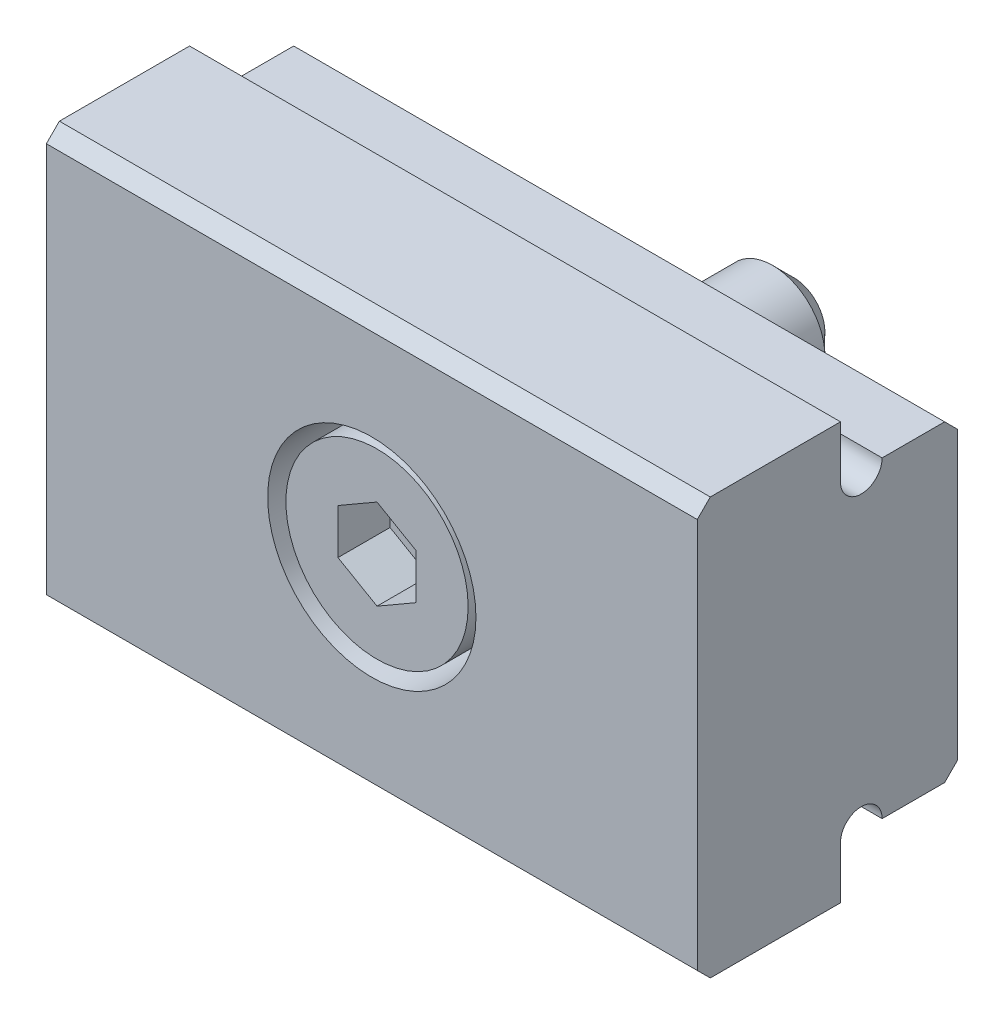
ISO-10303-21;
HEADER;
FILE_DESCRIPTION(('STEP AP214'),'2;1');
FILE_NAME('part.step','',(''),(''),'','','');
FILE_SCHEMA(('AUTOMOTIVE_DESIGN { 1 0 10303 214 1 1 1 1 }'));
ENDSEC;
DATA;
#1=APPLICATION_CONTEXT('core data for automotive mechanical design processes');
#2=APPLICATION_PROTOCOL_DEFINITION('international standard','automotive_design',2000,#1);
#3=PRODUCT_CONTEXT('',#1,'mechanical');
#4=PRODUCT('Part','Part','',(#3));
#5=PRODUCT_RELATED_PRODUCT_CATEGORY('part','',(#4));
#6=PRODUCT_DEFINITION_FORMATION('','',#4);
#7=PRODUCT_DEFINITION_CONTEXT('part definition',#1,'design');
#8=PRODUCT_DEFINITION('design','',#6,#7);
#9=PRODUCT_DEFINITION_SHAPE('','',#8);
#10=(LENGTH_UNIT() NAMED_UNIT(*) SI_UNIT(.MILLI.,.METRE.));
#11=(NAMED_UNIT(*) PLANE_ANGLE_UNIT() SI_UNIT($,.RADIAN.));
#12=(NAMED_UNIT(*) SI_UNIT($,.STERADIAN.) SOLID_ANGLE_UNIT());
#13=UNCERTAINTY_MEASURE_WITH_UNIT(LENGTH_MEASURE(1.E-05),#10,'distance_accuracy_value','');
#14=(GEOMETRIC_REPRESENTATION_CONTEXT(3) GLOBAL_UNCERTAINTY_ASSIGNED_CONTEXT((#13)) GLOBAL_UNIT_ASSIGNED_CONTEXT((#10,
#11,#12)) REPRESENTATION_CONTEXT('',''));
#15=CARTESIAN_POINT('',(0.,0.,0.));
#16=DIRECTION('',(0.,0.,1.));
#17=DIRECTION('',(1.,0.,0.));
#18=AXIS2_PLACEMENT_3D('',#15,#16,#17);
#19=CARTESIAN_POINT('',(2.,0.,-10.7));
#20=DIRECTION('',(0.,0.,-1.));
#21=DIRECTION('',(-1.,0.,0.));
#22=AXIS2_PLACEMENT_3D('',#19,#20,#21);
#23=PLANE('',#22);
#24=CARTESIAN_POINT('',(0.,0.,-10.7));
#25=DIRECTION('',(0.,0.,-1.));
#26=DIRECTION('',(-1.,0.,0.));
#27=AXIS2_PLACEMENT_3D('',#24,#25,#26);
#28=CIRCLE('',#27,1.2);
#29=CARTESIAN_POINT('',(-1.2,0.,-10.7));
#30=VERTEX_POINT('',#29);
#31=EDGE_CURVE('E24',#30,#30,#28,.T.);
#32=ORIENTED_EDGE('',*,*,#31,.T.);
#33=EDGE_LOOP('',(#32));
#34=FACE_BOUND('',#33,.T.);
#35=ADVANCED_FACE('F14',(#34),#23,.T.);
#36=CARTESIAN_POINT('',(0.,0.,-9.9));
#37=DIRECTION('',(0.,0.,1.));
#38=DIRECTION('',(1.,0.,0.));
#39=AXIS2_PLACEMENT_3D('',#36,#37,#38);
#40=CONICAL_SURFACE('',#39,2.,0.785398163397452);
#41=ORIENTED_EDGE('',*,*,#31,.F.);
#42=EDGE_LOOP('',(#41));
#43=FACE_BOUND('',#42,.T.);
#44=CARTESIAN_POINT('',(0.,0.,-9.9));
#45=DIRECTION('',(0.,0.,-1.));
#46=DIRECTION('',(-1.,0.,0.));
#47=AXIS2_PLACEMENT_3D('',#44,#45,#46);
#48=CIRCLE('',#47,2.);
#49=CARTESIAN_POINT('',(-2.,0.,-9.9));
#50=VERTEX_POINT('',#49);
#51=EDGE_CURVE('E212',#50,#50,#48,.F.);
#52=ORIENTED_EDGE('',*,*,#51,.F.);
#53=EDGE_LOOP('',(#52));
#54=FACE_BOUND('',#53,.T.);
#55=ADVANCED_FACE('F371',(#43,#54),#40,.T.);
#56=CARTESIAN_POINT('',(0.,0.,9.3));
#57=DIRECTION('',(0.,0.,1.));
#58=DIRECTION('',(1.,0.,0.));
#59=AXIS2_PLACEMENT_3D('',#56,#57,#58);
#60=CYLINDRICAL_SURFACE('',#59,2.);
#61=ORIENTED_EDGE('',*,*,#51,.T.);
#62=EDGE_LOOP('',(#61));
#63=FACE_BOUND('',#62,.T.);
#64=CARTESIAN_POINT('',(0.,0.,1.30000000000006));
#65=DIRECTION('',(0.,0.,1.));
#66=DIRECTION('',(1.,0.,0.));
#67=AXIS2_PLACEMENT_3D('',#64,#65,#66);
#68=CIRCLE('',#67,2.);
#69=CARTESIAN_POINT('',(2.,0.,1.30000000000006));
#70=VERTEX_POINT('',#69);
#71=EDGE_CURVE('E203',#70,#70,#68,.T.);
#72=ORIENTED_EDGE('',*,*,#71,.F.);
#73=EDGE_LOOP('',(#72));
#74=FACE_BOUND('',#73,.T.);
#75=ADVANCED_FACE('F360',(#63,#74),#60,.T.);
#76=CARTESIAN_POINT('',(3.5,0.,1.30000000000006));
#77=DIRECTION('',(0.,0.,-1.));
#78=DIRECTION('',(-1.,0.,0.));
#79=AXIS2_PLACEMENT_3D('',#76,#77,#78);
#80=PLANE('',#79);
#81=ORIENTED_EDGE('',*,*,#71,.T.);
#82=EDGE_LOOP('',(#81));
#83=FACE_BOUND('',#82,.T.);
#84=CARTESIAN_POINT('',(0.,0.,1.30000000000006));
#85=DIRECTION('',(0.,0.,-1.));
#86=DIRECTION('',(-1.,0.,0.));
#87=AXIS2_PLACEMENT_3D('',#84,#85,#86);
#88=CIRCLE('',#87,2.4);
#89=CARTESIAN_POINT('',(-2.4,0.,1.30000000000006));
#90=VERTEX_POINT('',#89);
#91=EDGE_CURVE('E9',#90,#90,#88,.T.);
#92=ORIENTED_EDGE('',*,*,#91,.T.);
#93=EDGE_LOOP('',(#92));
#94=FACE_BOUND('',#93,.T.);
#95=ADVANCED_FACE('F350',(#83,#94),#80,.T.);
#96=CARTESIAN_POINT('',(0.,1.73205080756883,3.30000000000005));
#97=DIRECTION('',(-0.5,-0.86602540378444,0.));
#98=DIRECTION('',(0.86602540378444,-0.5,0.));
#99=AXIS2_PLACEMENT_3D('',#96,#97,#98);
#100=PLANE('',#99);
#101=DIRECTION('',(0.,0.,1.));
#102=VECTOR('',#101,1.);
#103=CARTESIAN_POINT('',(1.5,0.866025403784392,3.30000000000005));
#104=LINE('',#103,#102);
#105=CARTESIAN_POINT('',(1.5,0.866025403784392,3.30000000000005));
#106=VERTEX_POINT('',#105);
#107=CARTESIAN_POINT('',(1.5,0.866025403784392,5.30000000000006));
#108=VERTEX_POINT('',#107);
#109=EDGE_CURVE('E132',#106,#108,#104,.T.);
#110=ORIENTED_EDGE('',*,*,#109,.T.);
#111=DIRECTION('',(0.86602540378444,-0.5,0.));
#112=VECTOR('',#111,1.);
#113=CARTESIAN_POINT('',(0.,1.73205080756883,5.30000000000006));
#114=LINE('',#113,#112);
#115=CARTESIAN_POINT('',(0.,1.73205080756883,5.30000000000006));
#116=VERTEX_POINT('',#115);
#117=EDGE_CURVE('E33',#116,#108,#114,.T.);
#118=ORIENTED_EDGE('',*,*,#117,.F.);
#119=DIRECTION('',(0.,0.,1.));
#120=VECTOR('',#119,1.);
#121=CARTESIAN_POINT('',(0.,1.73205080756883,3.30000000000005));
#122=LINE('',#121,#120);
#123=CARTESIAN_POINT('',(0.,1.73205080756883,3.30000000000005));
#124=VERTEX_POINT('',#123);
#125=EDGE_CURVE('E171',#124,#116,#122,.T.);
#126=ORIENTED_EDGE('',*,*,#125,.F.);
#127=DIRECTION('',(0.86602540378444,-0.5,0.));
#128=VECTOR('',#127,1.);
#129=CARTESIAN_POINT('',(0.,1.73205080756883,3.30000000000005));
#130=LINE('',#129,#128);
#131=EDGE_CURVE('E184',#124,#106,#130,.T.);
#132=ORIENTED_EDGE('',*,*,#131,.T.);
#133=EDGE_LOOP('',(#110,#118,#126,#132));
#134=FACE_BOUND('',#133,.T.);
#135=ADVANCED_FACE('F348',(#134),#100,.T.);
#136=CARTESIAN_POINT('',(1.5,-0.86602540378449,3.30000000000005));
#137=DIRECTION('',(1.,0.,0.));
#138=DIRECTION('',(0.,1.,0.));
#139=AXIS2_PLACEMENT_3D('',#136,#137,#138);
#140=PLANE('',#139);
#141=DIRECTION('',(0.,0.,1.));
#142=VECTOR('',#141,1.);
#143=CARTESIAN_POINT('',(1.5,-0.86602540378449,3.30000000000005));
#144=LINE('',#143,#142);
#145=CARTESIAN_POINT('',(1.5,-0.86602540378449,3.30000000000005));
#146=VERTEX_POINT('',#145);
#147=CARTESIAN_POINT('',(1.5,-0.86602540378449,5.30000000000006));
#148=VERTEX_POINT('',#147);
#149=EDGE_CURVE('E200',#146,#148,#144,.T.);
#150=ORIENTED_EDGE('',*,*,#149,.T.);
#151=DIRECTION('',(0.,1.,0.));
#152=VECTOR('',#151,1.);
#153=CARTESIAN_POINT('',(1.5,-0.86602540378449,5.30000000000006));
#154=LINE('',#153,#152);
#155=EDGE_CURVE('E325',#148,#108,#154,.T.);
#156=ORIENTED_EDGE('',*,*,#155,.T.);
#157=ORIENTED_EDGE('',*,*,#109,.F.);
#158=DIRECTION('',(0.,1.,0.));
#159=VECTOR('',#158,1.);
#160=CARTESIAN_POINT('',(1.5,-0.86602540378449,3.30000000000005));
#161=LINE('',#160,#159);
#162=EDGE_CURVE('E194',#146,#106,#161,.T.);
#163=ORIENTED_EDGE('',*,*,#162,.F.);
#164=EDGE_LOOP('',(#150,#156,#157,#163));
#165=FACE_BOUND('',#164,.T.);
#166=ADVANCED_FACE('F347',(#165),#140,.F.);
#167=CARTESIAN_POINT('',(0.,-1.73205080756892,3.30000000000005));
#168=DIRECTION('',(0.5,-0.86602540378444,0.));
#169=DIRECTION('',(0.86602540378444,0.5,0.));
#170=AXIS2_PLACEMENT_3D('',#167,#168,#169);
#171=PLANE('',#170);
#172=DIRECTION('',(0.,0.,1.));
#173=VECTOR('',#172,1.);
#174=CARTESIAN_POINT('',(0.,-1.73205080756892,3.30000000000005));
#175=LINE('',#174,#173);
#176=CARTESIAN_POINT('',(0.,-1.73205080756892,3.30000000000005));
#177=VERTEX_POINT('',#176);
#178=CARTESIAN_POINT('',(0.,-1.73205080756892,5.30000000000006));
#179=VERTEX_POINT('',#178);
#180=EDGE_CURVE('E198',#177,#179,#175,.T.);
#181=ORIENTED_EDGE('',*,*,#180,.T.);
#182=DIRECTION('',(0.86602540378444,0.5,0.));
#183=VECTOR('',#182,1.);
#184=CARTESIAN_POINT('',(0.,-1.73205080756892,5.30000000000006));
#185=LINE('',#184,#183);
#186=EDGE_CURVE('E328',#179,#148,#185,.T.);
#187=ORIENTED_EDGE('',*,*,#186,.T.);
#188=ORIENTED_EDGE('',*,*,#149,.F.);
#189=DIRECTION('',(0.86602540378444,0.5,0.));
#190=VECTOR('',#189,1.);
#191=CARTESIAN_POINT('',(0.,-1.73205080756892,3.30000000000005));
#192=LINE('',#191,#190);
#193=EDGE_CURVE('E191',#177,#146,#192,.T.);
#194=ORIENTED_EDGE('',*,*,#193,.F.);
#195=EDGE_LOOP('',(#181,#187,#188,#194));
#196=FACE_BOUND('',#195,.T.);
#197=ADVANCED_FACE('F346',(#196),#171,.F.);
#198=CARTESIAN_POINT('',(0.,-1.73205080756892,3.30000000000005));
#199=DIRECTION('',(0.5,0.86602540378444,0.));
#200=DIRECTION('',(-0.86602540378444,0.5,0.));
#201=AXIS2_PLACEMENT_3D('',#198,#199,#200);
#202=PLANE('',#201);
#203=DIRECTION('',(0.,0.,1.));
#204=VECTOR('',#203,1.);
#205=CARTESIAN_POINT('',(-1.5,-0.86602540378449,3.30000000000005));
#206=LINE('',#205,#204);
#207=CARTESIAN_POINT('',(-1.5,-0.86602540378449,3.30000000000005));
#208=VERTEX_POINT('',#207);
#209=CARTESIAN_POINT('',(-1.5,-0.86602540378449,5.30000000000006));
#210=VERTEX_POINT('',#209);
#211=EDGE_CURVE('E170',#208,#210,#206,.T.);
#212=ORIENTED_EDGE('',*,*,#211,.T.);
#213=DIRECTION('',(-0.86602540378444,0.5,0.));
#214=VECTOR('',#213,1.);
#215=CARTESIAN_POINT('',(0.,-1.73205080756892,5.30000000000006));
#216=LINE('',#215,#214);
#217=EDGE_CURVE('E331',#179,#210,#216,.T.);
#218=ORIENTED_EDGE('',*,*,#217,.F.);
#219=ORIENTED_EDGE('',*,*,#180,.F.);
#220=DIRECTION('',(-0.86602540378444,0.5,0.));
#221=VECTOR('',#220,1.);
#222=CARTESIAN_POINT('',(0.,-1.73205080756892,3.30000000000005));
#223=LINE('',#222,#221);
#224=EDGE_CURVE('E179',#177,#208,#223,.T.);
#225=ORIENTED_EDGE('',*,*,#224,.T.);
#226=EDGE_LOOP('',(#212,#218,#219,#225));
#227=FACE_BOUND('',#226,.T.);
#228=ADVANCED_FACE('F342',(#227),#202,.T.);
#229=CARTESIAN_POINT('',(-1.5,0.866025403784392,3.30000000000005));
#230=DIRECTION('',(-1.,0.,0.));
#231=DIRECTION('',(0.,-1.,0.));
#232=AXIS2_PLACEMENT_3D('',#229,#230,#231);
#233=PLANE('',#232);
#234=DIRECTION('',(0.,0.,1.));
#235=VECTOR('',#234,1.);
#236=CARTESIAN_POINT('',(-1.5,0.866025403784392,3.30000000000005));
#237=LINE('',#236,#235);
#238=CARTESIAN_POINT('',(-1.5,0.866025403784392,3.30000000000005));
#239=VERTEX_POINT('',#238);
#240=CARTESIAN_POINT('',(-1.5,0.866025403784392,5.30000000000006));
#241=VERTEX_POINT('',#240);
#242=EDGE_CURVE('E160',#239,#241,#237,.T.);
#243=ORIENTED_EDGE('',*,*,#242,.T.);
#244=DIRECTION('',(0.,-1.,0.));
#245=VECTOR('',#244,1.);
#246=CARTESIAN_POINT('',(-1.5,0.866025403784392,5.30000000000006));
#247=LINE('',#246,#245);
#248=EDGE_CURVE('E336',#241,#210,#247,.T.);
#249=ORIENTED_EDGE('',*,*,#248,.T.);
#250=ORIENTED_EDGE('',*,*,#211,.F.);
#251=DIRECTION('',(0.,-1.,0.));
#252=VECTOR('',#251,1.);
#253=CARTESIAN_POINT('',(-1.5,0.866025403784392,3.30000000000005));
#254=LINE('',#253,#252);
#255=EDGE_CURVE('E174',#239,#208,#254,.T.);
#256=ORIENTED_EDGE('',*,*,#255,.F.);
#257=EDGE_LOOP('',(#243,#249,#250,#256));
#258=FACE_BOUND('',#257,.T.);
#259=ADVANCED_FACE('F175',(#258),#233,.F.);
#260=CARTESIAN_POINT('',(0.,1.73205080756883,3.30000000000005));
#261=DIRECTION('',(-0.5,0.86602540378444,0.));
#262=DIRECTION('',(-0.86602540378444,-0.5,0.));
#263=AXIS2_PLACEMENT_3D('',#260,#261,#262);
#264=PLANE('',#263);
#265=DIRECTION('',(-0.86602540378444,-0.5,0.));
#266=VECTOR('',#265,1.);
#267=CARTESIAN_POINT('',(0.,1.73205080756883,3.30000000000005));
#268=LINE('',#267,#266);
#269=EDGE_CURVE('E164',#124,#239,#268,.T.);
#270=ORIENTED_EDGE('',*,*,#269,.F.);
#271=ORIENTED_EDGE('',*,*,#125,.T.);
#272=DIRECTION('',(-0.86602540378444,-0.5,0.));
#273=VECTOR('',#272,1.);
#274=CARTESIAN_POINT('',(0.,1.73205080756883,5.30000000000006));
#275=LINE('',#274,#273);
#276=EDGE_CURVE('E166',#116,#241,#275,.T.);
#277=ORIENTED_EDGE('',*,*,#276,.T.);
#278=ORIENTED_EDGE('',*,*,#242,.F.);
#279=EDGE_LOOP('',(#270,#271,#277,#278));
#280=FACE_BOUND('',#279,.T.);
#281=ADVANCED_FACE('F162',(#280),#264,.F.);
#282=CARTESIAN_POINT('',(1.5,0.866025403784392,3.30000000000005));
#283=DIRECTION('',(0.,0.,1.));
#284=DIRECTION('',(1.,0.,0.));
#285=AXIS2_PLACEMENT_3D('',#282,#283,#284);
#286=PLANE('',#285);
#287=ORIENTED_EDGE('',*,*,#131,.F.);
#288=ORIENTED_EDGE('',*,*,#269,.T.);
#289=ORIENTED_EDGE('',*,*,#255,.T.);
#290=ORIENTED_EDGE('',*,*,#224,.F.);
#291=ORIENTED_EDGE('',*,*,#193,.T.);
#292=ORIENTED_EDGE('',*,*,#162,.T.);
#293=EDGE_LOOP('',(#287,#288,#289,#290,#291,#292));
#294=FACE_BOUND('',#293,.T.);
#295=ADVANCED_FACE('F182',(#294),#286,.T.);
#296=CARTESIAN_POINT('',(0.,0.,5.30000000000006));
#297=DIRECTION('',(0.,0.,1.));
#298=DIRECTION('',(1.,0.,0.));
#299=AXIS2_PLACEMENT_3D('',#296,#297,#298);
#300=PLANE('',#299);
#301=CARTESIAN_POINT('',(0.,0.,5.30000000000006));
#302=DIRECTION('',(0.,0.,1.));
#303=DIRECTION('',(1.,0.,0.));
#304=AXIS2_PLACEMENT_3D('',#301,#302,#303);
#305=CIRCLE('',#304,3.5);
#306=CARTESIAN_POINT('',(3.5,0.,5.30000000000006));
#307=VERTEX_POINT('',#306);
#308=EDGE_CURVE('E209',#307,#307,#305,.T.);
#309=ORIENTED_EDGE('',*,*,#308,.T.);
#310=EDGE_LOOP('',(#309));
#311=FACE_BOUND('',#310,.T.);
#312=ORIENTED_EDGE('',*,*,#276,.F.);
#313=ORIENTED_EDGE('',*,*,#117,.T.);
#314=ORIENTED_EDGE('',*,*,#155,.F.);
#315=ORIENTED_EDGE('',*,*,#186,.F.);
#316=ORIENTED_EDGE('',*,*,#217,.T.);
#317=ORIENTED_EDGE('',*,*,#248,.F.);
#318=EDGE_LOOP('',(#312,#313,#314,#315,#316,#317));
#319=FACE_BOUND('',#318,.T.);
#320=ADVANCED_FACE('F340',(#311,#319),#300,.T.);
#321=CARTESIAN_POINT('',(0.,0.,9.3));
#322=DIRECTION('',(0.,0.,1.));
#323=DIRECTION('',(1.,0.,0.));
#324=AXIS2_PLACEMENT_3D('',#321,#322,#323);
#325=CYLINDRICAL_SURFACE('',#324,3.5);
#326=CARTESIAN_POINT('',(0.,0.,1.30000000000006));
#327=DIRECTION('',(0.,0.,1.));
#328=DIRECTION('',(1.,0.,0.));
#329=AXIS2_PLACEMENT_3D('',#326,#327,#328);
#330=CIRCLE('',#329,3.5);
#331=CARTESIAN_POINT('',(3.5,0.,1.30000000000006));
#332=VERTEX_POINT('',#331);
#333=EDGE_CURVE('E206',#332,#332,#330,.T.);
#334=ORIENTED_EDGE('',*,*,#333,.T.);
#335=EDGE_LOOP('',(#334));
#336=FACE_BOUND('',#335,.T.);
#337=ORIENTED_EDGE('',*,*,#308,.F.);
#338=EDGE_LOOP('',(#337));
#339=FACE_BOUND('',#338,.T.);
#340=ADVANCED_FACE('F385',(#336,#339),#325,.T.);
#341=CARTESIAN_POINT('',(12.5,6.,0.));
#342=DIRECTION('',(0.,0.,1.));
#343=DIRECTION('',(0.,-1.,0.));
#344=AXIS2_PLACEMENT_3D('',#341,#342,#343);
#345=PLANE('',#344);
#346=DIRECTION('',(0.,1.,0.));
#347=VECTOR('',#346,1.);
#348=CARTESIAN_POINT('',(-12.5,6.,0.));
#349=LINE('',#348,#347);
#350=CARTESIAN_POINT('',(-12.5,6.,0.));
#351=VERTEX_POINT('',#350);
#352=CARTESIAN_POINT('',(-12.5,8.,0.));
#353=VERTEX_POINT('',#352);
#354=EDGE_CURVE('E229',#351,#353,#349,.T.);
#355=ORIENTED_EDGE('',*,*,#354,.T.);
#356=DIRECTION('',(-1.,0.,0.));
#357=VECTOR('',#356,1.);
#358=CARTESIAN_POINT('',(12.5,8.,0.));
#359=LINE('',#358,#357);
#360=CARTESIAN_POINT('',(12.5,8.,0.));
#361=VERTEX_POINT('',#360);
#362=EDGE_CURVE('E316',#361,#353,#359,.T.);
#363=ORIENTED_EDGE('',*,*,#362,.F.);
#364=DIRECTION('',(0.,1.,0.));
#365=VECTOR('',#364,1.);
#366=CARTESIAN_POINT('',(12.5,6.,0.));
#367=LINE('',#366,#365);
#368=CARTESIAN_POINT('',(12.5,6.,0.));
#369=VERTEX_POINT('',#368);
#370=EDGE_CURVE('E257',#369,#361,#367,.T.);
#371=ORIENTED_EDGE('',*,*,#370,.F.);
#372=DIRECTION('',(-1.,0.,0.));
#373=VECTOR('',#372,1.);
#374=CARTESIAN_POINT('',(12.5,6.,0.));
#375=LINE('',#374,#373);
#376=EDGE_CURVE('E18',#369,#351,#375,.T.);
#377=ORIENTED_EDGE('',*,*,#376,.T.);
#378=EDGE_LOOP('',(#355,#363,#371,#377));
#379=FACE_BOUND('',#378,.T.);
#380=ADVANCED_FACE('F388',(#379),#345,.F.);
#381=CARTESIAN_POINT('',(12.5,8.,5.00000000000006));
#382=DIRECTION('',(0.,-1.,0.));
#383=DIRECTION('',(1.,0.,0.));
#384=AXIS2_PLACEMENT_3D('',#381,#382,#383);
#385=PLANE('',#384);
#386=DIRECTION('',(0.,0.,1.));
#387=VECTOR('',#386,1.);
#388=CARTESIAN_POINT('',(-12.5,8.,5.00000000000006));
#389=LINE('',#388,#387);
#390=CARTESIAN_POINT('',(-12.5,8.,5.00000000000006));
#391=VERTEX_POINT('',#390);
#392=EDGE_CURVE('E231',#353,#391,#389,.T.);
#393=ORIENTED_EDGE('',*,*,#392,.T.);
#394=DIRECTION('',(-1.,0.,0.));
#395=VECTOR('',#394,1.);
#396=CARTESIAN_POINT('',(12.5,8.,5.00000000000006));
#397=LINE('',#396,#395);
#398=CARTESIAN_POINT('',(12.5,8.,5.00000000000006));
#399=VERTEX_POINT('',#398);
#400=EDGE_CURVE('E314',#399,#391,#397,.T.);
#401=ORIENTED_EDGE('',*,*,#400,.F.);
#402=DIRECTION('',(0.,0.,1.));
#403=VECTOR('',#402,1.);
#404=CARTESIAN_POINT('',(12.5,8.,5.00000000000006));
#405=LINE('',#404,#403);
#406=EDGE_CURVE('E259',#361,#399,#405,.T.);
#407=ORIENTED_EDGE('',*,*,#406,.F.);
#408=ORIENTED_EDGE('',*,*,#362,.T.);
#409=EDGE_LOOP('',(#393,#401,#407,#408));
#410=FACE_BOUND('',#409,.T.);
#411=ADVANCED_FACE('F449',(#410),#385,.F.);
#412=CARTESIAN_POINT('',(12.5,7.5,5.5));
#413=DIRECTION('',(0.,-0.707106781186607,-0.707106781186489));
#414=DIRECTION('',(0.,0.707106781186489,-0.707106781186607));
#415=AXIS2_PLACEMENT_3D('',#412,#413,#414);
#416=PLANE('',#415);
#417=DIRECTION('',(0.,-0.707106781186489,0.707106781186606));
#418=VECTOR('',#417,1.);
#419=CARTESIAN_POINT('',(-12.5,7.5,5.5));
#420=LINE('',#419,#418);
#421=CARTESIAN_POINT('',(-12.5,7.5,5.5));
#422=VERTEX_POINT('',#421);
#423=EDGE_CURVE('E233',#391,#422,#420,.T.);
#424=ORIENTED_EDGE('',*,*,#423,.T.);
#425=DIRECTION('',(-1.,0.,0.));
#426=VECTOR('',#425,1.);
#427=CARTESIAN_POINT('',(12.5,7.5,5.5));
#428=LINE('',#427,#426);
#429=CARTESIAN_POINT('',(12.5,7.5,5.5));
#430=VERTEX_POINT('',#429);
#431=EDGE_CURVE('E311',#430,#422,#428,.T.);
#432=ORIENTED_EDGE('',*,*,#431,.F.);
#433=DIRECTION('',(0.,-0.707106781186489,0.707106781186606));
#434=VECTOR('',#433,1.);
#435=CARTESIAN_POINT('',(12.5,7.5,5.5));
#436=LINE('',#435,#434);
#437=EDGE_CURVE('E261',#399,#430,#436,.T.);
#438=ORIENTED_EDGE('',*,*,#437,.F.);
#439=ORIENTED_EDGE('',*,*,#400,.T.);
#440=EDGE_LOOP('',(#424,#432,#438,#439));
#441=FACE_BOUND('',#440,.T.);
#442=ADVANCED_FACE('F445',(#441),#416,.F.);
#443=CARTESIAN_POINT('',(12.5,7.5,5.5));
#444=DIRECTION('',(0.,0.,-1.));
#445=DIRECTION('',(0.,1.,0.));
#446=AXIS2_PLACEMENT_3D('',#443,#444,#445);
#447=PLANE('',#446);
#448=CARTESIAN_POINT('',(0.,0.,5.5));
#449=DIRECTION('',(0.,0.,1.));
#450=DIRECTION('',(1.,0.,0.));
#451=AXIS2_PLACEMENT_3D('',#448,#449,#450);
#452=CIRCLE('',#451,4.);
#453=CARTESIAN_POINT('',(4.,0.,5.5));
#454=VERTEX_POINT('',#453);
#455=EDGE_CURVE('E223',#454,#454,#452,.T.);
#456=ORIENTED_EDGE('',*,*,#455,.F.);
#457=EDGE_LOOP('',(#456));
#458=FACE_BOUND('',#457,.T.);
#459=DIRECTION('',(0.,-1.,0.));
#460=VECTOR('',#459,1.);
#461=CARTESIAN_POINT('',(-12.5,7.5,5.5));
#462=LINE('',#461,#460);
#463=CARTESIAN_POINT('',(-12.5,-7.5,5.5));
#464=VERTEX_POINT('',#463);
#465=EDGE_CURVE('E235',#422,#464,#462,.T.);
#466=ORIENTED_EDGE('',*,*,#465,.T.);
#467=DIRECTION('',(-1.,0.,0.));
#468=VECTOR('',#467,1.);
#469=CARTESIAN_POINT('',(12.5,-7.5,5.5));
#470=LINE('',#469,#468);
#471=CARTESIAN_POINT('',(12.5,-7.5,5.5));
#472=VERTEX_POINT('',#471);
#473=EDGE_CURVE('E308',#472,#464,#470,.T.);
#474=ORIENTED_EDGE('',*,*,#473,.F.);
#475=DIRECTION('',(0.,-1.,0.));
#476=VECTOR('',#475,1.);
#477=CARTESIAN_POINT('',(12.5,7.5,5.5));
#478=LINE('',#477,#476);
#479=EDGE_CURVE('E263',#430,#472,#478,.T.);
#480=ORIENTED_EDGE('',*,*,#479,.F.);
#481=ORIENTED_EDGE('',*,*,#431,.T.);
#482=EDGE_LOOP('',(#466,#474,#480,#481));
#483=FACE_BOUND('',#482,.T.);
#484=ADVANCED_FACE('F400',(#458,#483),#447,.F.);
#485=CARTESIAN_POINT('',(0.,0.,5.5));
#486=DIRECTION('',(0.,0.,1.));
#487=DIRECTION('',(1.,0.,0.));
#488=AXIS2_PLACEMENT_3D('',#485,#486,#487);
#489=CYLINDRICAL_SURFACE('',#488,4.);
#490=CARTESIAN_POINT('',(0.,0.,1.30000000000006));
#491=DIRECTION('',(0.,0.,1.));
#492=DIRECTION('',(1.,0.,0.));
#493=AXIS2_PLACEMENT_3D('',#490,#491,#492);
#494=CIRCLE('',#493,4.);
#495=CARTESIAN_POINT('',(4.,0.,1.30000000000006));
#496=VERTEX_POINT('',#495);
#497=EDGE_CURVE('E220',#496,#496,#494,.T.);
#498=ORIENTED_EDGE('',*,*,#497,.F.);
#499=EDGE_LOOP('',(#498));
#500=FACE_BOUND('',#499,.T.);
#501=ORIENTED_EDGE('',*,*,#455,.T.);
#502=EDGE_LOOP('',(#501));
#503=FACE_BOUND('',#502,.T.);
#504=ADVANCED_FACE('F396',(#500,#503),#489,.F.);
#505=CARTESIAN_POINT('',(0.,2.39999999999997,1.30000000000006));
#506=DIRECTION('',(0.,0.,-1.));
#507=DIRECTION('',(-1.,0.,0.));
#508=AXIS2_PLACEMENT_3D('',#505,#506,#507);
#509=PLANE('',#508);
#510=ORIENTED_EDGE('',*,*,#333,.F.);
#511=EDGE_LOOP('',(#510));
#512=FACE_BOUND('',#511,.T.);
#513=ORIENTED_EDGE('',*,*,#497,.T.);
#514=EDGE_LOOP('',(#513));
#515=FACE_BOUND('',#514,.T.);
#516=ADVANCED_FACE('F369',(#512,#515),#509,.F.);
#517=CARTESIAN_POINT('',(12.5,-7.5,5.5));
#518=DIRECTION('',(0.,0.707106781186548,-0.707106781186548));
#519=DIRECTION('',(0.,0.707106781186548,0.707106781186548));
#520=AXIS2_PLACEMENT_3D('',#517,#518,#519);
#521=PLANE('',#520);
#522=DIRECTION('',(0.,-0.707106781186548,-0.707106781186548));
#523=VECTOR('',#522,1.);
#524=CARTESIAN_POINT('',(-12.5,-7.5,5.5));
#525=LINE('',#524,#523);
#526=CARTESIAN_POINT('',(-12.5,-8.,5.00000000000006));
#527=VERTEX_POINT('',#526);
#528=EDGE_CURVE('E237',#464,#527,#525,.T.);
#529=ORIENTED_EDGE('',*,*,#528,.T.);
#530=DIRECTION('',(-1.,0.,0.));
#531=VECTOR('',#530,1.);
#532=CARTESIAN_POINT('',(12.5,-8.,5.00000000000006));
#533=LINE('',#532,#531);
#534=CARTESIAN_POINT('',(12.5,-8.,5.00000000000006));
#535=VERTEX_POINT('',#534);
#536=EDGE_CURVE('E305',#535,#527,#533,.T.);
#537=ORIENTED_EDGE('',*,*,#536,.F.);
#538=DIRECTION('',(0.,-0.707106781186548,-0.707106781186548));
#539=VECTOR('',#538,1.);
#540=CARTESIAN_POINT('',(12.5,-7.5,5.5));
#541=LINE('',#540,#539);
#542=EDGE_CURVE('E265',#472,#535,#541,.T.);
#543=ORIENTED_EDGE('',*,*,#542,.F.);
#544=ORIENTED_EDGE('',*,*,#473,.T.);
#545=EDGE_LOOP('',(#529,#537,#543,#544));
#546=FACE_BOUND('',#545,.T.);
#547=ADVANCED_FACE('F395',(#546),#521,.F.);
#548=CARTESIAN_POINT('',(12.5,-8.,5.00000000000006));
#549=DIRECTION('',(0.,1.,0.));
#550=DIRECTION('',(-1.,0.,0.));
#551=AXIS2_PLACEMENT_3D('',#548,#549,#550);
#552=PLANE('',#551);
#553=DIRECTION('',(0.,0.,-1.));
#554=VECTOR('',#553,1.);
#555=CARTESIAN_POINT('',(-12.5,-8.,5.00000000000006));
#556=LINE('',#555,#554);
#557=CARTESIAN_POINT('',(-12.5,-8.,0.));
#558=VERTEX_POINT('',#557);
#559=EDGE_CURVE('E239',#527,#558,#556,.T.);
#560=ORIENTED_EDGE('',*,*,#559,.T.);
#561=DIRECTION('',(-1.,0.,0.));
#562=VECTOR('',#561,1.);
#563=CARTESIAN_POINT('',(12.5,-8.,0.));
#564=LINE('',#563,#562);
#565=CARTESIAN_POINT('',(12.5,-8.,0.));
#566=VERTEX_POINT('',#565);
#567=EDGE_CURVE('E302',#566,#558,#564,.T.);
#568=ORIENTED_EDGE('',*,*,#567,.F.);
#569=DIRECTION('',(0.,0.,-1.));
#570=VECTOR('',#569,1.);
#571=CARTESIAN_POINT('',(12.5,-8.,5.00000000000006));
#572=LINE('',#571,#570);
#573=EDGE_CURVE('E267',#535,#566,#572,.T.);
#574=ORIENTED_EDGE('',*,*,#573,.F.);
#575=ORIENTED_EDGE('',*,*,#536,.T.);
#576=EDGE_LOOP('',(#560,#568,#574,#575));
#577=FACE_BOUND('',#576,.T.);
#578=ADVANCED_FACE('F435',(#577),#552,.F.);
#579=CARTESIAN_POINT('',(12.5,-8.,0.));
#580=DIRECTION('',(0.,0.,1.));
#581=DIRECTION('',(0.,-1.,0.));
#582=AXIS2_PLACEMENT_3D('',#579,#580,#581);
#583=PLANE('',#582);
#584=DIRECTION('',(0.,1.,0.));
#585=VECTOR('',#584,1.);
#586=CARTESIAN_POINT('',(-12.5,-8.,0.));
#587=LINE('',#586,#585);
#588=CARTESIAN_POINT('',(-12.5,-6.0000000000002,0.));
#589=VERTEX_POINT('',#588);
#590=EDGE_CURVE('E241',#558,#589,#587,.T.);
#591=ORIENTED_EDGE('',*,*,#590,.T.);
#592=DIRECTION('',(-1.,0.,0.));
#593=VECTOR('',#592,1.);
#594=CARTESIAN_POINT('',(12.5,-6.0000000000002,0.));
#595=LINE('',#594,#593);
#596=CARTESIAN_POINT('',(12.5,-6.0000000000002,0.));
#597=VERTEX_POINT('',#596);
#598=EDGE_CURVE('E299',#597,#589,#595,.T.);
#599=ORIENTED_EDGE('',*,*,#598,.F.);
#600=DIRECTION('',(0.,1.,0.));
#601=VECTOR('',#600,1.);
#602=CARTESIAN_POINT('',(12.5,-8.,0.));
#603=LINE('',#602,#601);
#604=EDGE_CURVE('E269',#566,#597,#603,.T.);
#605=ORIENTED_EDGE('',*,*,#604,.F.);
#606=ORIENTED_EDGE('',*,*,#567,.T.);
#607=EDGE_LOOP('',(#591,#599,#605,#606));
#608=FACE_BOUND('',#607,.T.);
#609=ADVANCED_FACE('F431',(#608),#583,.F.);
#610=CARTESIAN_POINT('',(12.5,-6.0000000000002,-0.799999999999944));
#611=DIRECTION('',(-1.,0.,0.));
#612=DIRECTION('',(0.,-1.,0.));
#613=AXIS2_PLACEMENT_3D('',#610,#611,#612);
#614=CYLINDRICAL_SURFACE('',#613,0.800000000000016);
#615=CARTESIAN_POINT('',(-12.5,-6.0000000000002,-0.799999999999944));
#616=DIRECTION('',(-1.,0.,0.));
#617=DIRECTION('',(0.,1.,0.));
#618=AXIS2_PLACEMENT_3D('',#615,#616,#617);
#619=CIRCLE('',#618,0.800000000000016);
#620=CARTESIAN_POINT('',(-12.5,-6.,-1.59999999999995));
#621=VERTEX_POINT('',#620);
#622=EDGE_CURVE('E243',#589,#621,#619,.T.);
#623=ORIENTED_EDGE('',*,*,#622,.T.);
#624=DIRECTION('',(-1.,0.,0.));
#625=VECTOR('',#624,1.);
#626=CARTESIAN_POINT('',(12.5,-6.,-1.59999999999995));
#627=LINE('',#626,#625);
#628=CARTESIAN_POINT('',(12.5,-6.,-1.59999999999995));
#629=VERTEX_POINT('',#628);
#630=EDGE_CURVE('E296',#629,#621,#627,.T.);
#631=ORIENTED_EDGE('',*,*,#630,.F.);
#632=CARTESIAN_POINT('',(12.5,-6.0000000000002,-0.799999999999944));
#633=DIRECTION('',(-1.,0.,0.));
#634=DIRECTION('',(0.,1.,0.));
#635=AXIS2_PLACEMENT_3D('',#632,#633,#634);
#636=CIRCLE('',#635,0.800000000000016);
#637=EDGE_CURVE('E271',#597,#629,#636,.T.);
#638=ORIENTED_EDGE('',*,*,#637,.F.);
#639=ORIENTED_EDGE('',*,*,#598,.T.);
#640=EDGE_LOOP('',(#623,#631,#638,#639));
#641=FACE_BOUND('',#640,.T.);
#642=ADVANCED_FACE('F427',(#641),#614,.F.);
#643=CARTESIAN_POINT('',(12.5,-6.,-1.59999999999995));
#644=DIRECTION('',(0.,1.,0.));
#645=DIRECTION('',(0.,0.,1.));
#646=AXIS2_PLACEMENT_3D('',#643,#644,#645);
#647=PLANE('',#646);
#648=DIRECTION('',(0.,0.,-1.));
#649=VECTOR('',#648,1.);
#650=CARTESIAN_POINT('',(-12.5,-6.,-1.59999999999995));
#651=LINE('',#650,#649);
#652=CARTESIAN_POINT('',(-12.5,-6.,-3.99999999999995));
#653=VERTEX_POINT('',#652);
#654=EDGE_CURVE('E245',#621,#653,#651,.T.);
#655=ORIENTED_EDGE('',*,*,#654,.T.);
#656=DIRECTION('',(-1.,0.,0.));
#657=VECTOR('',#656,1.);
#658=CARTESIAN_POINT('',(12.5,-6.,-3.99999999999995));
#659=LINE('',#658,#657);
#660=CARTESIAN_POINT('',(12.5,-6.,-3.99999999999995));
#661=VERTEX_POINT('',#660);
#662=EDGE_CURVE('E293',#661,#653,#659,.T.);
#663=ORIENTED_EDGE('',*,*,#662,.F.);
#664=DIRECTION('',(0.,0.,-1.));
#665=VECTOR('',#664,1.);
#666=CARTESIAN_POINT('',(12.5,-6.,-1.59999999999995));
#667=LINE('',#666,#665);
#668=EDGE_CURVE('E273',#629,#661,#667,.T.);
#669=ORIENTED_EDGE('',*,*,#668,.F.);
#670=ORIENTED_EDGE('',*,*,#630,.T.);
#671=EDGE_LOOP('',(#655,#663,#669,#670));
#672=FACE_BOUND('',#671,.T.);
#673=ADVANCED_FACE('F414',(#672),#647,.F.);
#674=CARTESIAN_POINT('',(12.5,6.,-1.59999999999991));
#675=DIRECTION('',(0.,-1.,0.));
#676=DIRECTION('',(1.,0.,0.));
#677=AXIS2_PLACEMENT_3D('',#674,#675,#676);
#678=PLANE('',#677);
#679=DIRECTION('',(0.,0.,1.));
#680=VECTOR('',#679,1.);
#681=CARTESIAN_POINT('',(-12.5,6.,-1.59999999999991));
#682=LINE('',#681,#680);
#683=CARTESIAN_POINT('',(-12.5,6.,-3.99999999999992));
#684=VERTEX_POINT('',#683);
#685=CARTESIAN_POINT('',(-12.5,6.,-1.59999999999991));
#686=VERTEX_POINT('',#685);
#687=EDGE_CURVE('E253',#684,#686,#682,.T.);
#688=ORIENTED_EDGE('',*,*,#687,.T.);
#689=DIRECTION('',(-1.,0.,0.));
#690=VECTOR('',#689,1.);
#691=CARTESIAN_POINT('',(12.5,6.,-1.59999999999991));
#692=LINE('',#691,#690);
#693=CARTESIAN_POINT('',(12.5,6.,-1.59999999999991));
#694=VERTEX_POINT('',#693);
#695=EDGE_CURVE('E281',#694,#686,#692,.T.);
#696=ORIENTED_EDGE('',*,*,#695,.F.);
#697=DIRECTION('',(0.,0.,1.));
#698=VECTOR('',#697,1.);
#699=CARTESIAN_POINT('',(12.5,6.,-1.59999999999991));
#700=LINE('',#699,#698);
#701=CARTESIAN_POINT('',(12.5,6.,-3.99999999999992));
#702=VERTEX_POINT('',#701);
#703=EDGE_CURVE('E126',#702,#694,#700,.T.);
#704=ORIENTED_EDGE('',*,*,#703,.F.);
#705=DIRECTION('',(-1.,0.,0.));
#706=VECTOR('',#705,1.);
#707=CARTESIAN_POINT('',(12.5,6.,-3.99999999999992));
#708=LINE('',#707,#706);
#709=EDGE_CURVE('E284',#702,#684,#708,.T.);
#710=ORIENTED_EDGE('',*,*,#709,.T.);
#711=EDGE_LOOP('',(#688,#696,#704,#710));
#712=FACE_BOUND('',#711,.T.);
#713=ADVANCED_FACE('F411',(#712),#678,.F.);
#714=CARTESIAN_POINT('',(12.5,6.,-0.799999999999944));
#715=DIRECTION('',(-1.,0.,0.));
#716=DIRECTION('',(0.,-1.,0.));
#717=AXIS2_PLACEMENT_3D('',#714,#715,#716);
#718=CYLINDRICAL_SURFACE('',#717,0.799999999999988);
#719=CARTESIAN_POINT('',(-12.5,6.,-0.799999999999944));
#720=DIRECTION('',(-1.,0.,0.));
#721=DIRECTION('',(0.,1.,0.));
#722=AXIS2_PLACEMENT_3D('',#719,#720,#721);
#723=CIRCLE('',#722,0.799999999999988);
#724=EDGE_CURVE('E226',#686,#351,#723,.T.);
#725=ORIENTED_EDGE('',*,*,#724,.T.);
#726=ORIENTED_EDGE('',*,*,#376,.F.);
#727=CARTESIAN_POINT('',(12.5,6.,-0.799999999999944));
#728=DIRECTION('',(-1.,0.,0.));
#729=DIRECTION('',(0.,1.,0.));
#730=AXIS2_PLACEMENT_3D('',#727,#728,#729);
#731=CIRCLE('',#730,0.799999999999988);
#732=EDGE_CURVE('E255',#694,#369,#731,.T.);
#733=ORIENTED_EDGE('',*,*,#732,.F.);
#734=ORIENTED_EDGE('',*,*,#695,.T.);
#735=EDGE_LOOP('',(#725,#726,#733,#734));
#736=FACE_BOUND('',#735,.T.);
#737=ADVANCED_FACE('F16',(#736),#718,.F.);
#738=CARTESIAN_POINT('',(12.5,-6.,-3.99999999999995));
#739=DIRECTION('',(0.,0.707106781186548,0.707106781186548));
#740=DIRECTION('',(0.,-0.707106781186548,0.707106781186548));
#741=AXIS2_PLACEMENT_3D('',#738,#739,#740);
#742=PLANE('',#741);
#743=DIRECTION('',(0.,0.707106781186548,-0.707106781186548));
#744=VECTOR('',#743,1.);
#745=CARTESIAN_POINT('',(-12.5,-6.,-3.99999999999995));
#746=LINE('',#745,#744);
#747=CARTESIAN_POINT('',(-12.5,-5.5,-4.49999999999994));
#748=VERTEX_POINT('',#747);
#749=EDGE_CURVE('E247',#653,#748,#746,.T.);
#750=ORIENTED_EDGE('',*,*,#749,.T.);
#751=DIRECTION('',(-1.,0.,0.));
#752=VECTOR('',#751,1.);
#753=CARTESIAN_POINT('',(12.5,-5.5,-4.49999999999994));
#754=LINE('',#753,#752);
#755=CARTESIAN_POINT('',(12.5,-5.5,-4.49999999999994));
#756=VERTEX_POINT('',#755);
#757=EDGE_CURVE('E290',#756,#748,#754,.T.);
#758=ORIENTED_EDGE('',*,*,#757,.F.);
#759=DIRECTION('',(0.,0.707106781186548,-0.707106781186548));
#760=VECTOR('',#759,1.);
#761=CARTESIAN_POINT('',(12.5,-6.,-3.99999999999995));
#762=LINE('',#761,#760);
#763=EDGE_CURVE('E275',#661,#756,#762,.T.);
#764=ORIENTED_EDGE('',*,*,#763,.F.);
#765=ORIENTED_EDGE('',*,*,#662,.T.);
#766=EDGE_LOOP('',(#750,#758,#764,#765));
#767=FACE_BOUND('',#766,.T.);
#768=ADVANCED_FACE('F410',(#767),#742,.F.);
#769=CARTESIAN_POINT('',(12.5,6.,-0.799999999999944));
#770=DIRECTION('',(1.,0.,0.));
#771=DIRECTION('',(0.,1.,0.));
#772=AXIS2_PLACEMENT_3D('',#769,#770,#771);
#773=PLANE('',#772);
#774=ORIENTED_EDGE('',*,*,#732,.T.);
#775=ORIENTED_EDGE('',*,*,#370,.T.);
#776=ORIENTED_EDGE('',*,*,#406,.T.);
#777=ORIENTED_EDGE('',*,*,#437,.T.);
#778=ORIENTED_EDGE('',*,*,#479,.T.);
#779=ORIENTED_EDGE('',*,*,#542,.T.);
#780=ORIENTED_EDGE('',*,*,#573,.T.);
#781=ORIENTED_EDGE('',*,*,#604,.T.);
#782=ORIENTED_EDGE('',*,*,#637,.T.);
#783=ORIENTED_EDGE('',*,*,#668,.T.);
#784=ORIENTED_EDGE('',*,*,#763,.T.);
#785=DIRECTION('',(0.,1.,0.));
#786=VECTOR('',#785,1.);
#787=CARTESIAN_POINT('',(12.5,-5.5,-4.49999999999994));
#788=LINE('',#787,#786);
#789=CARTESIAN_POINT('',(12.5,5.5,-4.49999999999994));
#790=VERTEX_POINT('',#789);
#791=EDGE_CURVE('E277',#756,#790,#788,.T.);
#792=ORIENTED_EDGE('',*,*,#791,.T.);
#793=DIRECTION('',(0.,0.707106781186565,0.70710678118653));
#794=VECTOR('',#793,1.);
#795=CARTESIAN_POINT('',(12.5,6.,-3.99999999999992));
#796=LINE('',#795,#794);
#797=EDGE_CURVE('E121',#790,#702,#796,.T.);
#798=ORIENTED_EDGE('',*,*,#797,.T.);
#799=ORIENTED_EDGE('',*,*,#703,.T.);
#800=EDGE_LOOP('',(#774,#775,#776,#777,#778,#779,#780,#781,#782,#783,#784,#792,#798,#799));
#801=FACE_BOUND('',#800,.T.);
#802=ADVANCED_FACE('F407',(#801),#773,.T.);
#803=CARTESIAN_POINT('',(12.5,6.,-3.99999999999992));
#804=DIRECTION('',(0.,-0.707106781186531,0.707106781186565));
#805=DIRECTION('',(0.,-0.707106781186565,-0.70710678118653));
#806=AXIS2_PLACEMENT_3D('',#803,#804,#805);
#807=PLANE('',#806);
#808=DIRECTION('',(0.,0.707106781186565,0.70710678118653));
#809=VECTOR('',#808,1.);
#810=CARTESIAN_POINT('',(-12.5,6.,-3.99999999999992));
#811=LINE('',#810,#809);
#812=CARTESIAN_POINT('',(-12.5,5.5,-4.49999999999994));
#813=VERTEX_POINT('',#812);
#814=EDGE_CURVE('E251',#813,#684,#811,.T.);
#815=ORIENTED_EDGE('',*,*,#814,.T.);
#816=ORIENTED_EDGE('',*,*,#709,.F.);
#817=ORIENTED_EDGE('',*,*,#797,.F.);
#818=DIRECTION('',(-1.,0.,0.));
#819=VECTOR('',#818,1.);
#820=CARTESIAN_POINT('',(12.5,5.5,-4.49999999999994));
#821=LINE('',#820,#819);
#822=EDGE_CURVE('E287',#790,#813,#821,.T.);
#823=ORIENTED_EDGE('',*,*,#822,.T.);
#824=EDGE_LOOP('',(#815,#816,#817,#823));
#825=FACE_BOUND('',#824,.T.);
#826=ADVANCED_FACE('F405',(#825),#807,.F.);
#827=CARTESIAN_POINT('',(-12.5,6.,-0.799999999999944));
#828=DIRECTION('',(1.,0.,0.));
#829=DIRECTION('',(0.,1.,0.));
#830=AXIS2_PLACEMENT_3D('',#827,#828,#829);
#831=PLANE('',#830);
#832=ORIENTED_EDGE('',*,*,#724,.F.);
#833=ORIENTED_EDGE('',*,*,#687,.F.);
#834=ORIENTED_EDGE('',*,*,#814,.F.);
#835=DIRECTION('',(0.,1.,0.));
#836=VECTOR('',#835,1.);
#837=CARTESIAN_POINT('',(-12.5,-5.5,-4.49999999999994));
#838=LINE('',#837,#836);
#839=EDGE_CURVE('E249',#748,#813,#838,.T.);
#840=ORIENTED_EDGE('',*,*,#839,.F.);
#841=ORIENTED_EDGE('',*,*,#749,.F.);
#842=ORIENTED_EDGE('',*,*,#654,.F.);
#843=ORIENTED_EDGE('',*,*,#622,.F.);
#844=ORIENTED_EDGE('',*,*,#590,.F.);
#845=ORIENTED_EDGE('',*,*,#559,.F.);
#846=ORIENTED_EDGE('',*,*,#528,.F.);
#847=ORIENTED_EDGE('',*,*,#465,.F.);
#848=ORIENTED_EDGE('',*,*,#423,.F.);
#849=ORIENTED_EDGE('',*,*,#392,.F.);
#850=ORIENTED_EDGE('',*,*,#354,.F.);
#851=EDGE_LOOP('',(#832,#833,#834,#840,#841,#842,#843,#844,#845,#846,#847,#848,#849,#850));
#852=FACE_BOUND('',#851,.T.);
#853=ADVANCED_FACE('F402',(#852),#831,.F.);
#854=CARTESIAN_POINT('',(12.5,-5.5,-4.49999999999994));
#855=DIRECTION('',(0.,0.,1.));
#856=DIRECTION('',(1.,0.,0.));
#857=AXIS2_PLACEMENT_3D('',#854,#855,#856);
#858=PLANE('',#857);
#859=CARTESIAN_POINT('',(0.,0.,-4.5));
#860=DIRECTION('',(0.,0.,1.));
#861=DIRECTION('',(1.,0.,0.));
#862=AXIS2_PLACEMENT_3D('',#859,#860,#861);
#863=CIRCLE('',#862,2.4);
#864=CARTESIAN_POINT('',(2.4,0.,-4.5));
#865=VERTEX_POINT('',#864);
#866=EDGE_CURVE('E217',#865,#865,#863,.T.);
#867=ORIENTED_EDGE('',*,*,#866,.T.);
#868=EDGE_LOOP('',(#867));
#869=FACE_BOUND('',#868,.T.);
#870=ORIENTED_EDGE('',*,*,#839,.T.);
#871=ORIENTED_EDGE('',*,*,#822,.F.);
#872=ORIENTED_EDGE('',*,*,#791,.F.);
#873=ORIENTED_EDGE('',*,*,#757,.T.);
#874=EDGE_LOOP('',(#870,#871,#872,#873));
#875=FACE_BOUND('',#874,.T.);
#876=ADVANCED_FACE('F366',(#869,#875),#858,.F.);
#877=CARTESIAN_POINT('',(0.,0.,5.5));
#878=DIRECTION('',(0.,0.,1.));
#879=DIRECTION('',(1.,0.,0.));
#880=AXIS2_PLACEMENT_3D('',#877,#878,#879);
#881=CYLINDRICAL_SURFACE('',#880,2.4);
#882=ORIENTED_EDGE('',*,*,#866,.F.);
#883=EDGE_LOOP('',(#882));
#884=FACE_BOUND('',#883,.T.);
#885=ORIENTED_EDGE('',*,*,#91,.F.);
#886=EDGE_LOOP('',(#885));
#887=FACE_BOUND('',#886,.T.);
#888=ADVANCED_FACE('F352',(#884,#887),#881,.F.);
#889=CLOSED_SHELL('',(#35,#55,#75,#95,#135,#166,#197,#228,#259,#281,#295,#320,#340,#380,#411,
#442,#484,#504,#516,#547,#578,#609,#642,#673,#713,#737,#768,#802,#826,#853,#876,#888));
#890=MANIFOLD_SOLID_BREP('B1',#889);
#891=ADVANCED_BREP_SHAPE_REPRESENTATION('',(#18,#890),#14);
#892=SHAPE_DEFINITION_REPRESENTATION(#9,#891);
ENDSEC;
END-ISO-10303-21;
